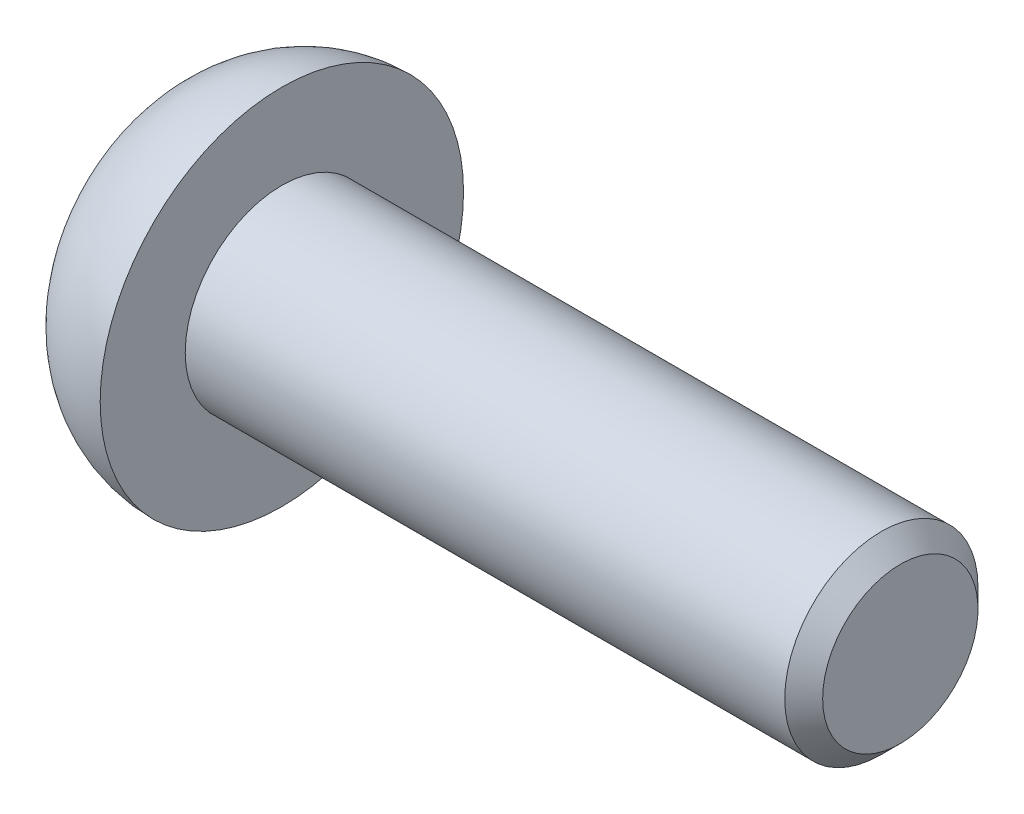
ISO-10303-21;
HEADER;
FILE_DESCRIPTION(('STEP AP214'),'2;1');
FILE_NAME('part.step','',(''),(''),'','','');
FILE_SCHEMA(('AUTOMOTIVE_DESIGN { 1 0 10303 214 1 1 1 1 }'));
ENDSEC;
DATA;
#1=APPLICATION_CONTEXT('core data for automotive mechanical design processes');
#2=APPLICATION_PROTOCOL_DEFINITION('international standard','automotive_design',2000,#1);
#3=PRODUCT_CONTEXT('',#1,'mechanical');
#4=PRODUCT('Part','Part','',(#3));
#5=PRODUCT_RELATED_PRODUCT_CATEGORY('part','',(#4));
#6=PRODUCT_DEFINITION_FORMATION('','',#4);
#7=PRODUCT_DEFINITION_CONTEXT('part definition',#1,'design');
#8=PRODUCT_DEFINITION('design','',#6,#7);
#9=PRODUCT_DEFINITION_SHAPE('','',#8);
#10=(LENGTH_UNIT() NAMED_UNIT(*) SI_UNIT(.MILLI.,.METRE.));
#11=(NAMED_UNIT(*) PLANE_ANGLE_UNIT() SI_UNIT($,.RADIAN.));
#12=(NAMED_UNIT(*) SI_UNIT($,.STERADIAN.) SOLID_ANGLE_UNIT());
#13=UNCERTAINTY_MEASURE_WITH_UNIT(LENGTH_MEASURE(1.E-05),#10,'distance_accuracy_value','');
#14=(GEOMETRIC_REPRESENTATION_CONTEXT(3) GLOBAL_UNCERTAINTY_ASSIGNED_CONTEXT((#13)) GLOBAL_UNIT_ASSIGNED_CONTEXT((#10,
#11,#12)) REPRESENTATION_CONTEXT('',''));
#15=CARTESIAN_POINT('',(0.,0.,0.));
#16=DIRECTION('',(0.,0.,1.));
#17=DIRECTION('',(1.,0.,0.));
#18=AXIS2_PLACEMENT_3D('',#15,#16,#17);
#19=CARTESIAN_POINT('',(-2.7,0.,0.));
#20=DIRECTION('',(1.,0.,0.));
#21=DIRECTION('',(0.,0.,-1.));
#22=AXIS2_PLACEMENT_3D('',#19,#20,#21);
#23=PLANE('',#22);
#24=CARTESIAN_POINT('',(-2.7,0.,0.));
#25=DIRECTION('',(-1.,0.,0.));
#26=DIRECTION('',(0.,0.,1.));
#27=AXIS2_PLACEMENT_3D('',#24,#25,#26);
#28=CIRCLE('',#27,3.3618598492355);
#29=CARTESIAN_POINT('',(-2.7,0.,3.3618598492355));
#30=VERTEX_POINT('',#29);
#31=EDGE_CURVE('E209',#30,#30,#28,.T.);
#32=ORIENTED_EDGE('',*,*,#31,.T.);
#33=EDGE_LOOP('',(#32));
#34=FACE_BOUND('',#33,.T.);
#35=CARTESIAN_POINT('',(-2.7,0.,0.));
#36=DIRECTION('',(1.,0.,0.));
#37=DIRECTION('',(0.,0.,-1.));
#38=AXIS2_PLACEMENT_3D('',#35,#36,#37);
#39=CIRCLE('',#38,2.35);
#40=CARTESIAN_POINT('',(-2.7,0.,-2.35));
#41=VERTEX_POINT('',#40);
#42=EDGE_CURVE('E196',#41,#41,#39,.F.);
#43=ORIENTED_EDGE('',*,*,#42,.F.);
#44=EDGE_LOOP('',(#43));
#45=FACE_BOUND('',#44,.T.);
#46=ADVANCED_FACE('F34',(#34,#45),#23,.F.);
#47=CARTESIAN_POINT('',(0.,0.,0.));
#48=DIRECTION('',(-1.,0.,0.));
#49=DIRECTION('',(0.,0.,1.));
#50=AXIS2_PLACEMENT_3D('',#47,#48,#49);
#51=DEGENERATE_TOROIDAL_SURFACE('',#50,1.30700000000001,3.39299999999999,.T.);
#52=ORIENTED_EDGE('',*,*,#31,.F.);
#53=EDGE_LOOP('',(#52));
#54=FACE_BOUND('',#53,.T.);
#55=CARTESIAN_POINT('',(0.,0.,0.));
#56=DIRECTION('',(-1.,0.,0.));
#57=DIRECTION('',(0.,0.,1.));
#58=AXIS2_PLACEMENT_3D('',#55,#56,#57);
#59=CIRCLE('',#58,4.7);
#60=CARTESIAN_POINT('',(0.,0.,4.7));
#61=VERTEX_POINT('',#60);
#62=EDGE_CURVE('E206',#61,#61,#59,.T.);
#63=ORIENTED_EDGE('',*,*,#62,.T.);
#64=EDGE_LOOP('',(#63));
#65=FACE_BOUND('',#64,.T.);
#66=ADVANCED_FACE('F246',(#54,#65),#51,.T.);
#67=CARTESIAN_POINT('',(0.,4.7,0.));
#68=DIRECTION('',(-1.,0.,0.));
#69=DIRECTION('',(0.,0.,1.));
#70=AXIS2_PLACEMENT_3D('',#67,#68,#69);
#71=PLANE('',#70);
#72=ORIENTED_EDGE('',*,*,#62,.F.);
#73=EDGE_LOOP('',(#72));
#74=FACE_BOUND('',#73,.T.);
#75=CARTESIAN_POINT('',(0.,0.,0.));
#76=DIRECTION('',(-1.,0.,0.));
#77=DIRECTION('',(0.,0.,1.));
#78=AXIS2_PLACEMENT_3D('',#75,#76,#77);
#79=CIRCLE('',#78,2.5);
#80=CARTESIAN_POINT('',(0.,0.,2.5));
#81=VERTEX_POINT('',#80);
#82=EDGE_CURVE('E203',#81,#81,#79,.T.);
#83=ORIENTED_EDGE('',*,*,#82,.T.);
#84=EDGE_LOOP('',(#83));
#85=FACE_BOUND('',#84,.T.);
#86=ADVANCED_FACE('F251',(#74,#85),#71,.F.);
#87=CARTESIAN_POINT('',(16.,0.,0.));
#88=DIRECTION('',(-1.,0.,0.));
#89=DIRECTION('',(0.,0.,1.));
#90=AXIS2_PLACEMENT_3D('',#87,#88,#89);
#91=CYLINDRICAL_SURFACE('',#90,2.5);
#92=ORIENTED_EDGE('',*,*,#82,.F.);
#93=EDGE_LOOP('',(#92));
#94=FACE_BOUND('',#93,.T.);
#95=CARTESIAN_POINT('',(15.5095,0.,0.));
#96=DIRECTION('',(-1.,0.,0.));
#97=DIRECTION('',(0.,0.,1.));
#98=AXIS2_PLACEMENT_3D('',#95,#96,#97);
#99=CIRCLE('',#98,2.5);
#100=CARTESIAN_POINT('',(15.5095,0.,2.5));
#101=VERTEX_POINT('',#100);
#102=EDGE_CURVE('E200',#101,#101,#99,.T.);
#103=ORIENTED_EDGE('',*,*,#102,.T.);
#104=EDGE_LOOP('',(#103));
#105=FACE_BOUND('',#104,.T.);
#106=ADVANCED_FACE('F270',(#94,#105),#91,.T.);
#107=CARTESIAN_POINT('',(16.,0.,0.));
#108=DIRECTION('',(-1.,0.,0.));
#109=DIRECTION('',(0.,0.,1.));
#110=AXIS2_PLACEMENT_3D('',#107,#108,#109);
#111=CONICAL_SURFACE('',#110,2.0095,0.785398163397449);
#112=ORIENTED_EDGE('',*,*,#102,.F.);
#113=EDGE_LOOP('',(#112));
#114=FACE_BOUND('',#113,.T.);
#115=CARTESIAN_POINT('',(16.,0.,0.));
#116=DIRECTION('',(-1.,0.,0.));
#117=DIRECTION('',(0.,0.,1.));
#118=AXIS2_PLACEMENT_3D('',#115,#116,#117);
#119=CIRCLE('',#118,2.0095);
#120=CARTESIAN_POINT('',(16.,0.,2.0095));
#121=VERTEX_POINT('',#120);
#122=EDGE_CURVE('E197',#121,#121,#119,.T.);
#123=ORIENTED_EDGE('',*,*,#122,.T.);
#124=EDGE_LOOP('',(#123));
#125=FACE_BOUND('',#124,.T.);
#126=ADVANCED_FACE('F263',(#114,#125),#111,.T.);
#127=CARTESIAN_POINT('',(16.,2.0095,0.));
#128=DIRECTION('',(-1.,0.,0.));
#129=DIRECTION('',(0.,0.,1.));
#130=AXIS2_PLACEMENT_3D('',#127,#128,#129);
#131=PLANE('',#130);
#132=ORIENTED_EDGE('',*,*,#122,.F.);
#133=EDGE_LOOP('',(#132));
#134=FACE_BOUND('',#133,.T.);
#135=ADVANCED_FACE('F258',(#134),#131,.F.);
#136=CARTESIAN_POINT('',(-2.0253193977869,0.,0.));
#137=DIRECTION('',(-1.,0.,0.));
#138=DIRECTION('',(0.,-1.,0.));
#139=AXIS2_PLACEMENT_3D('',#136,#137,#138);
#140=CYLINDRICAL_SURFACE('',#139,2.35);
#141=CARTESIAN_POINT('',(-2.655,0.,0.));
#142=DIRECTION('',(-1.,0.,0.));
#143=DIRECTION('',(0.,-1.,0.));
#144=AXIS2_PLACEMENT_3D('',#141,#142,#143);
#145=CIRCLE('',#144,2.35);
#146=CARTESIAN_POINT('',(-2.655,-2.35,0.));
#147=VERTEX_POINT('',#146);
#148=EDGE_CURVE('E174',#147,#147,#145,.T.);
#149=ORIENTED_EDGE('',*,*,#148,.F.);
#150=EDGE_LOOP('',(#149));
#151=FACE_BOUND('',#150,.T.);
#152=ORIENTED_EDGE('',*,*,#42,.T.);
#153=EDGE_LOOP('',(#152));
#154=FACE_BOUND('',#153,.T.);
#155=ADVANCED_FACE('F243',(#151,#154),#140,.F.);
#156=CARTESIAN_POINT('',(-2.0253193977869,0.,0.));
#157=DIRECTION('',(-1.,0.,0.));
#158=DIRECTION('',(0.,-1.,0.));
#159=AXIS2_PLACEMENT_3D('',#156,#157,#158);
#160=CONICAL_SURFACE('',#159,0.,1.30899693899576);
#161=CARTESIAN_POINT('',(-2.55114544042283,0.439753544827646,1.9125030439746));
#162=CARTESIAN_POINT('',(-2.54071561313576,0.449737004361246,1.87022562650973));
#163=CARTESIAN_POINT('',(-2.5307382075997,0.463293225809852,1.82865349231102));
#164=CARTESIAN_POINT('',(-2.51220763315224,0.497228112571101,1.74795500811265));
#165=CARTESIAN_POINT('',(-2.50365739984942,0.517620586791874,1.70883380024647));
#166=CARTESIAN_POINT('',(-2.48853284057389,0.564906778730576,1.63418174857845));
#167=CARTESIAN_POINT('',(-2.48196233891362,0.591812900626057,1.59865794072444));
#168=CARTESIAN_POINT('',(-2.47137390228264,0.651414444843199,1.53246945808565));
#169=CARTESIAN_POINT('',(-2.46735280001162,0.684102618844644,1.50179878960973));
#170=CARTESIAN_POINT('',(-2.46236108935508,0.75278870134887,1.44755487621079));
#171=CARTESIAN_POINT('',(-2.46126404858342,0.788577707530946,1.42372873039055));
#172=CARTESIAN_POINT('',(-2.46186376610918,0.863523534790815,1.38219827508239));
#173=CARTESIAN_POINT('',(-2.46356024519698,0.902680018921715,1.36449335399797));
#174=CARTESIAN_POINT('',(-2.46947697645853,0.981800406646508,1.3361750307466));
#175=CARTESIAN_POINT('',(-2.47361092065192,1.02169350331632,1.32534425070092));
#176=CARTESIAN_POINT('',(-2.48399181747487,1.10243546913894,1.31002812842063));
#177=CARTESIAN_POINT('',(-2.49024044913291,1.14328507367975,1.30554784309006));
#178=CARTESIAN_POINT('',(-2.50478059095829,1.22698093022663,1.30286548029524));
#179=CARTESIAN_POINT('',(-2.51316049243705,1.26982205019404,1.30499743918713));
#180=CARTESIAN_POINT('',(-2.53126708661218,1.35428061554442,1.31603359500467));
#181=CARTESIAN_POINT('',(-2.5409921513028,1.39589946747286,1.32492966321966));
#182=CARTESIAN_POINT('',(-2.55114621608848,1.4364025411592,1.33709018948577));
#183=B_SPLINE_CURVE_WITH_KNOTS('',3,(#161,#162,#163,#164,#165,#166,#167,#168,#169,#170,#171,
#172,#173,#174,#175,#176,#177,#178,#179,#180,#181,#182),.UNSPECIFIED.,.F.,.F.,(4,2,2,2,2,2,2,2,
2,2,4),(0.,0.133919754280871,0.268111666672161,0.402561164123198,0.536843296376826,
0.665217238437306,0.793578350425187,0.917646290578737,1.04181297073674,1.17235260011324,
1.30273560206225),.UNSPECIFIED.);
#184=CARTESIAN_POINT('',(-2.55109606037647,0.43980094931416,1.9123030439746));
#185=VERTEX_POINT('',#184);
#186=CARTESIAN_POINT('',(-2.55109606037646,1.4362025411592,1.3370303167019));
#187=VERTEX_POINT('',#186);
#188=EDGE_CURVE('E11',#185,#187,#183,.T.);
#189=ORIENTED_EDGE('',*,*,#188,.F.);
#190=CARTESIAN_POINT('',(-2.5510466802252,-0.439848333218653,1.91210304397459));
#191=CARTESIAN_POINT('',(-2.55717942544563,-0.433993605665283,1.93693413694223));
#192=CARTESIAN_POINT('',(-2.56309008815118,-0.425982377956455,1.96131383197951));
#193=CARTESIAN_POINT('',(-2.57435861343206,-0.405906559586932,2.00848949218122));
#194=CARTESIAN_POINT('',(-2.57971629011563,-0.393840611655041,2.03128492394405));
#195=CARTESIAN_POINT('',(-2.58977141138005,-0.365904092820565,2.0746170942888));
#196=CARTESIAN_POINT('',(-2.59446813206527,-0.350029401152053,2.09515135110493));
#197=CARTESIAN_POINT('',(-2.60309788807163,-0.314913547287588,2.13327568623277));
#198=CARTESIAN_POINT('',(-2.607031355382,-0.295674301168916,2.15086742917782));
#199=CARTESIAN_POINT('',(-2.61399024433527,-0.254755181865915,2.18224039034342));
#200=CARTESIAN_POINT('',(-2.61703154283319,-0.233128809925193,2.19608784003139));
#201=CARTESIAN_POINT('',(-2.6222449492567,-0.187756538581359,2.21995686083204));
#202=CARTESIAN_POINT('',(-2.62441696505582,-0.164010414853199,2.22997802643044));
#203=CARTESIAN_POINT('',(-2.62780973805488,-0.115636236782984,2.24568124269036));
#204=CARTESIAN_POINT('',(-2.62905021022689,-0.0910387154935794,2.25145316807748));
#205=CARTESIAN_POINT('',(-2.63063260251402,-0.0412008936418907,2.25882234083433));
#206=CARTESIAN_POINT('',(-2.63097468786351,-0.0159607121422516,2.26042035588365));
#207=CARTESIAN_POINT('',(-2.63075535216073,0.0341234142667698,2.25939721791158));
#208=CARTESIAN_POINT('',(-2.63020479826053,0.0589684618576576,2.25682681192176));
#209=CARTESIAN_POINT('',(-2.62823116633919,0.107865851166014,2.24764508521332));
#210=CARTESIAN_POINT('',(-2.62680802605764,0.131918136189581,2.24103347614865));
#211=CARTESIAN_POINT('',(-2.62311568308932,0.178560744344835,2.22397704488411));
#212=CARTESIAN_POINT('',(-2.62084621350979,0.201150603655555,2.21353101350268));
#213=CARTESIAN_POINT('',(-2.61550455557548,0.244239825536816,2.18913496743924));
#214=CARTESIAN_POINT('',(-2.61243249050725,0.264739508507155,2.17518549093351));
#215=CARTESIAN_POINT('',(-2.60550026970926,0.303348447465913,2.14401587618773));
#216=CARTESIAN_POINT('',(-2.60163097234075,0.321425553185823,2.12675797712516));
#217=CARTESIAN_POINT('',(-2.59319880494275,0.354438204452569,2.08959540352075));
#218=CARTESIAN_POINT('',(-2.58863559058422,0.369372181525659,2.06968941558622));
#219=CARTESIAN_POINT('',(-2.57886409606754,0.39582442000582,2.02765264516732));
#220=CARTESIAN_POINT('',(-2.57365119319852,0.407315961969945,2.00550615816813));
#221=CARTESIAN_POINT('',(-2.56271023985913,0.426493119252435,1.95974792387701));
#222=CARTESIAN_POINT('',(-2.55698232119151,0.434179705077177,1.93613655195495));
#223=CARTESIAN_POINT('',(-2.5510466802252,0.439848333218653,1.91210304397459));
#224=B_SPLINE_CURVE_WITH_KNOTS('',3,(#190,#191,#192,#193,#194,#195,#196,#197,#198,#199,#200,
#201,#202,#203,#204,#205,#206,#207,#208,#209,#210,#211,#212,#213,#214,#215,#216,#217,#218,#219,
#220,#221,#222,#223),.UNSPECIFIED.,.F.,.F.,(4,2,2,2,2,2,2,2,2,2,2,2,2,2,2,2,4),(0.,
0.0786310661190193,0.157288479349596,0.236031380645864,0.314729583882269,0.391927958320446,
0.469134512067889,0.544657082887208,0.62016576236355,0.694762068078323,0.769363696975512,
0.843988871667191,0.918602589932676,0.99412494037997,1.06968488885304,1.14581696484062,
1.22192961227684),.UNSPECIFIED.);
#225=CARTESIAN_POINT('',(-2.55109606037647,-0.43980094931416,1.9123030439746));
#226=VERTEX_POINT('',#225);
#227=EDGE_CURVE('E128',#226,#185,#224,.T.);
#228=ORIENTED_EDGE('',*,*,#227,.F.);
#229=CARTESIAN_POINT('',(-2.55114621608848,-1.4364025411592,1.33709018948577));
#230=CARTESIAN_POINT('',(-2.5407163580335,-1.3947975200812,1.3245972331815));
#231=CARTESIAN_POINT('',(-2.53073891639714,-1.35201689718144,1.3155510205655));
#232=CARTESIAN_POINT('',(-2.51220825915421,-1.26516251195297,1.30458990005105));
#233=CARTESIAN_POINT('',(-2.50365797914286,-1.2210862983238,1.3026895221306));
#234=CARTESIAN_POINT('',(-2.48853331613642,-1.13279256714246,1.30631419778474));
#235=CARTESIAN_POINT('',(-2.48196275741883,-1.08857494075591,1.31185351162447));
#236=CARTESIAN_POINT('',(-2.47137419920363,-1.00145314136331,1.33037540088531));
#237=CARTESIAN_POINT('',(-2.46735303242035,-0.958547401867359,1.34334870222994));
#238=CARTESIAN_POINT('',(-2.46236119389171,-0.877227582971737,1.37571035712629));
#239=CARTESIAN_POINT('',(-2.46126408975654,-0.838698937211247,1.39479134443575));
#240=CARTESIAN_POINT('',(-2.46186368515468,-0.765259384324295,1.43893087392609));
#241=CARTESIAN_POINT('',(-2.46356010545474,-0.730348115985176,1.46398881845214));
#242=CARTESIAN_POINT('',(-2.46947672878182,-0.666263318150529,1.51834972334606));
#243=CARTESIAN_POINT('',(-2.47361062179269,-0.63693693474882,1.54748266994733));
#244=CARTESIAN_POINT('',(-2.48399142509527,-0.583301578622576,1.609749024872));
#245=CARTESIAN_POINT('',(-2.49024001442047,-0.558996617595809,1.64288559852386));
#246=CARTESIAN_POINT('',(-2.50478006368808,-0.514825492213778,1.71402693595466));
#247=CARTESIAN_POINT('',(-2.51315991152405,-0.495251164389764,1.75219426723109));
#248=CARTESIAN_POINT('',(-2.53126640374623,-0.462579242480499,1.83085532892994));
#249=CARTESIAN_POINT('',(-2.54099142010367,-0.449473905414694,1.87134621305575));
#250=CARTESIAN_POINT('',(-2.55114544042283,-0.439753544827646,1.9125030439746));
#251=B_SPLINE_CURVE_WITH_KNOTS('',3,(#229,#230,#231,#232,#233,#234,#235,#236,#237,#238,#239,
#240,#241,#242,#243,#244,#245,#246,#247,#248,#249,#250),.UNSPECIFIED.,.F.,.F.,(4,2,2,2,2,2,2,2,
2,2,4),(0.,0.133919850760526,0.268111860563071,0.402561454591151,0.536843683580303,
0.665217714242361,0.793578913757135,0.917646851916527,1.04181352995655,1.17235288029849,
1.30273560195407),.UNSPECIFIED.);
#252=CARTESIAN_POINT('',(-2.55109606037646,-1.4362025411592,1.3370303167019));
#253=VERTEX_POINT('',#252);
#254=EDGE_CURVE('E219',#253,#226,#251,.T.);
#255=ORIENTED_EDGE('',*,*,#254,.F.);
#256=CARTESIAN_POINT('',(-2.55102602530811,-1.87579142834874,0.57507272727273));
#257=CARTESIAN_POINT('',(-2.55715934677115,-1.89437192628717,0.592555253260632));
#258=CARTESIAN_POINT('',(-2.56307065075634,-1.9114835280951,0.611679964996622));
#259=CARTESIAN_POINT('',(-2.57434057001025,-1.94230894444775,0.652648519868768));
#260=CARTESIAN_POINT('',(-2.57969899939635,-1.95602161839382,0.674493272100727));
#261=CARTESIAN_POINT('',(-2.58975571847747,-1.97958890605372,0.720349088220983));
#262=CARTESIAN_POINT('',(-2.59445328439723,-1.98943931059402,0.744362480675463));
#263=CARTESIAN_POINT('',(-2.60308480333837,-2.0049073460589,0.793833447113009));
#264=CARTESIAN_POINT('',(-2.60701918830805,-2.0105273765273,0.819290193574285));
#265=CARTESIAN_POINT('',(-2.61397994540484,-2.0172470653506,0.870412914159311));
#266=CARTESIAN_POINT('',(-2.61702219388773,-2.01843083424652,0.89606565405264));
#267=CARTESIAN_POINT('',(-2.62223753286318,-2.0164251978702,0.947294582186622));
#268=CARTESIAN_POINT('',(-2.62441053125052,-2.01323532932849,0.972870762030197));
#269=CARTESIAN_POINT('',(-2.62780525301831,-2.0026565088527,1.02261800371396));
#270=CARTESIAN_POINT('',(-2.62904669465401,-1.99536067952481,1.04680754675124));
#271=CARTESIAN_POINT('',(-2.63063102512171,-1.97683190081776,1.09365666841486));
#272=CARTESIAN_POINT('',(-2.63097407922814,-1.96559967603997,1.11631652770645));
#273=CARTESIAN_POINT('',(-2.6307566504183,-1.93967899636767,1.15918397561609));
#274=CARTESIAN_POINT('',(-2.63020704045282,-1.92503396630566,1.17941789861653));
#275=CARTESIAN_POINT('',(-2.62823527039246,-1.89264019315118,1.21717933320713));
#276=CARTESIAN_POINT('',(-2.62681304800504,-1.87489122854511,1.23470665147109));
#277=CARTESIAN_POINT('',(-2.62312251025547,-1.83680413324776,1.26657891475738));
#278=CARTESIAN_POINT('',(-2.6208539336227,-1.8164652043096,1.28092287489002));
#279=CARTESIAN_POINT('',(-2.61551401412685,-1.77379741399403,1.30604873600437));
#280=CARTESIAN_POINT('',(-2.61244279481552,-1.75146885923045,1.31683118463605));
#281=CARTESIAN_POINT('',(-2.60551223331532,-1.70517395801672,1.33469081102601));
#282=CARTESIAN_POINT('',(-2.60164375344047,-1.68119098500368,1.34172129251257));
#283=CARTESIAN_POINT('',(-2.59321314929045,-1.63250291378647,1.35173837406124));
#284=CARTESIAN_POINT('',(-2.58865067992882,-1.60779746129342,1.35472295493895));
#285=CARTESIAN_POINT('',(-2.57887781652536,-1.55815287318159,1.35662221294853));
#286=CARTESIAN_POINT('',(-2.57366245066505,-1.53321347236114,1.3555035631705));
#287=CARTESIAN_POINT('',(-2.56271592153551,-1.48396894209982,1.34923304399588));
#288=CARTESIAN_POINT('',(-2.55698488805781,-1.45966365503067,1.34408218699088));
#289=CARTESIAN_POINT('',(-2.55104590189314,-1.4360025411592,1.33697042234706));
#290=B_SPLINE_CURVE_WITH_KNOTS('',3,(#256,#257,#258,#259,#260,#261,#262,#263,#264,#265,#266,
#267,#268,#269,#270,#271,#272,#273,#274,#275,#276,#277,#278,#279,#280,#281,#282,#283,#284,#285,
#286,#287,#288,#289),.UNSPECIFIED.,.F.,.F.,(4,2,2,2,2,2,2,2,2,2,2,2,2,2,2,2,4),(0.,
0.0786321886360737,0.157290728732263,0.236034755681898,0.314734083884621,0.391933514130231,
0.469141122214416,0.544664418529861,0.620173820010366,0.694770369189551,0.769372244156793,
0.843997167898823,0.918610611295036,0.994132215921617,1.06969149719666,1.14586583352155,
1.22202105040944),.UNSPECIFIED.);
#291=CARTESIAN_POINT('',(-2.55109606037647,-1.8760034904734,0.57527272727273));
#292=VERTEX_POINT('',#291);
#293=EDGE_CURVE('E476',#292,#253,#290,.T.);
#294=ORIENTED_EDGE('',*,*,#293,.F.);
#295=CARTESIAN_POINT('',(-2.55116211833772,-1.87620349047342,-0.575461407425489));
#296=CARTESIAN_POINT('',(-2.54073162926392,-1.84457888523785,-0.54567916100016));
#297=CARTESIAN_POINT('',(-2.53075344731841,-1.81535129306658,-0.513155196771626));
#298=CARTESIAN_POINT('',(-2.51222109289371,-1.76242518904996,-0.44342118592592));
#299=CARTESIAN_POINT('',(-2.5036698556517,-1.73873803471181,-0.406201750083));
#300=CARTESIAN_POINT('',(-2.48854306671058,-1.6977235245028,-0.32792720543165));
#301=CARTESIAN_POINT('',(-2.48197133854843,-1.6804084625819,-0.286864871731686));
#302=CARTESIAN_POINT('',(-2.47138028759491,-1.65288106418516,-0.202155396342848));
#303=CARTESIAN_POINT('',(-2.46735779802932,-1.64265991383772,-0.158511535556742));
#304=CARTESIAN_POINT('',(-2.46236333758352,-1.6300192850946,-0.071905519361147));
#305=CARTESIAN_POINT('',(-2.4612649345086,-1.62727632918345,-0.0289978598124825));
#306=CARTESIAN_POINT('',(-2.46186202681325,-1.62877621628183,0.0566737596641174));
#307=CARTESIAN_POINT('',(-2.46355724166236,-1.63301835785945,0.0994377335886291));
#308=CARTESIAN_POINT('',(-2.46947165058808,-1.64804812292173,0.182119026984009));
#309=CARTESIAN_POINT('',(-2.47360449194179,-1.65861197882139,0.222083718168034));
#310=CARTESIAN_POINT('',(-2.48398337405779,-1.68571310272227,0.299668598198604));
#311=CARTESIAN_POINT('',(-2.49023109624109,-1.70225512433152,0.337286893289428));
#312=CARTESIAN_POINT('',(-2.50477321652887,-1.74178459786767,0.411132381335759));
#313=CARTESIAN_POINT('',(-2.51315691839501,-1.76506170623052,0.447186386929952));
#314=CARTESIAN_POINT('',(-2.53127244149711,-1.81687418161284,0.514844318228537));
#315=CARTESIAN_POINT('',(-2.54100263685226,-1.84540322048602,0.546453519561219));
#316=CARTESIAN_POINT('',(-2.55116211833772,-1.87620349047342,0.575461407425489));
#317=B_SPLINE_CURVE_WITH_KNOTS('',3,(#295,#296,#297,#298,#299,#300,#301,#302,#303,#304,#305,
#306,#307,#308,#309,#310,#311,#312,#313,#314,#315,#316),.UNSPECIFIED.,.F.,.F.,(4,2,2,2,2,2,2,2,
2,2,4),(0.,0.133921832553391,0.268115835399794,0.402567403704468,0.536851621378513,
0.665227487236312,0.793590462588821,0.917658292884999,1.04182499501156,1.17242797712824,
1.30287461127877),.UNSPECIFIED.);
#318=CARTESIAN_POINT('',(-2.55109606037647,-1.8760034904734,-0.57527272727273));
#319=VERTEX_POINT('',#318);
#320=EDGE_CURVE('E469',#319,#292,#317,.T.);
#321=ORIENTED_EDGE('',*,*,#320,.F.);
#322=CARTESIAN_POINT('',(-2.55104590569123,-1.436002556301,-1.33697042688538));
#323=CARTESIAN_POINT('',(-2.55717867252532,-1.46043423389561,-1.34431580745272));
#324=CARTESIAN_POINT('',(-2.56308935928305,-1.48555325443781,-1.34956790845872));
#325=CARTESIAN_POINT('',(-2.57435793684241,-1.53644645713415,-1.35576993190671));
#326=CARTESIAN_POINT('',(-2.57971564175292,-1.5622208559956,-1.35671841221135));
#327=CARTESIAN_POINT('',(-2.5897708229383,-1.61371591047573,-1.35419112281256));
#328=CARTESIAN_POINT('',(-2.59446757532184,-1.63943647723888,-1.35071054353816));
#329=CARTESIAN_POINT('',(-2.60309739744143,-1.69001114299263,-1.33936183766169));
#330=CARTESIAN_POINT('',(-2.60703089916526,-1.71486572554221,-1.33149620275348));
#331=CARTESIAN_POINT('',(-2.61398985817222,-1.76249521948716,-1.31174600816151));
#332=CARTESIAN_POINT('',(-2.61703119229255,-1.78530073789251,-1.29994089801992));
#333=CARTESIAN_POINT('',(-2.62224467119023,-1.82865825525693,-1.27258215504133));
#334=CARTESIAN_POINT('',(-2.62441672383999,-1.84921001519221,-1.25702812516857));
#335=CARTESIAN_POINT('',(-2.62780956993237,-1.88699673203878,-1.22298671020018));
#336=CARTESIAN_POINT('',(-2.62905007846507,-1.90429425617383,-1.20457070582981));
#337=CARTESIAN_POINT('',(-2.63063254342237,-1.93559533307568,-1.16509467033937));
#338=CARTESIAN_POINT('',(-2.63097466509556,-1.94959949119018,-1.1440351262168));
#339=CARTESIAN_POINT('',(-2.63075540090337,-1.97375578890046,-1.10014958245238));
#340=CARTESIAN_POINT('',(-2.6302048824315,-1.98395242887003,-1.07734800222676));
#341=CARTESIAN_POINT('',(-2.62823132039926,-2.00044982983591,-1.03041085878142));
#342=CARTESIAN_POINT('',(-2.6268082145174,-2.00675031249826,-1.00627520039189));
#343=CARTESIAN_POINT('',(-2.62311593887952,-2.0153006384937,-0.957353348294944));
#344=CARTESIAN_POINT('',(-2.62084650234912,-2.01754920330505,-0.932566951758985));
#345=CARTESIAN_POINT('',(-2.61550490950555,-2.01796654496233,-0.883052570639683));
#346=CARTESIAN_POINT('',(-2.61243287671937,-2.01613594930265,-0.858324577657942));
#347=CARTESIAN_POINT('',(-2.60550072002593,-2.00844706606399,-0.809303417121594));
#348=CARTESIAN_POINT('',(-2.60163145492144,-2.00254000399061,-0.785019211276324));
#349=CARTESIAN_POINT('',(-2.59319934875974,-1.98686292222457,-0.737848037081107));
#350=CARTESIAN_POINT('',(-2.58863616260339,-1.97709097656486,-0.714961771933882));
#351=CARTESIAN_POINT('',(-2.57886178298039,-1.95390550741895,-0.671021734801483));
#352=CARTESIAN_POINT('',(-2.57364559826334,-1.94046287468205,-0.649984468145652));
#353=CARTESIAN_POINT('',(-2.56269749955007,-1.91040208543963,-0.610476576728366));
#354=CARTESIAN_POINT('',(-2.55696571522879,-1.89378472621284,-0.592005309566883));
#355=CARTESIAN_POINT('',(-2.55102602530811,-1.87579142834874,-0.57507272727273));
#356=B_SPLINE_CURVE_WITH_KNOTS('',3,(#322,#323,#324,#325,#326,#327,#328,#329,#330,#331,#332,
#333,#334,#335,#336,#337,#338,#339,#340,#341,#342,#343,#344,#345,#346,#347,#348,#349,#350,#351,
#352,#353,#354,#355),.UNSPECIFIED.,.F.,.F.,(4,2,2,2,2,2,2,2,2,2,2,2,2,2,2,2,4),(0.,
0.0786311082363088,0.157288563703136,0.236031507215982,0.314729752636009,0.391928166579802,
0.469134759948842,0.544657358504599,0.620166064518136,0.694762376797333,0.76936401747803,
0.843989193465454,0.918602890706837,0.994125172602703,1.06968513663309,1.14586263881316,
1.22202103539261),.UNSPECIFIED.);
#357=CARTESIAN_POINT('',(-2.55109606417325,-1.436202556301,-1.3370303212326));
#358=VERTEX_POINT('',#357);
#359=EDGE_CURVE('E464',#358,#319,#356,.T.);
#360=ORIENTED_EDGE('',*,*,#359,.F.);
#361=CARTESIAN_POINT('',(-2.5511454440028,-0.439753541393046,-1.9125030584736));
#362=CARTESIAN_POINT('',(-2.54071561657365,-0.449737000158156,-1.87022564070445));
#363=CARTESIAN_POINT('',(-2.53073821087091,-0.463293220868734,-1.82865350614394));
#364=CARTESIAN_POINT('',(-2.51220763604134,-0.497228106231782,-1.7479550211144));
#365=CARTESIAN_POINT('',(-2.503657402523,-0.517620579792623,-1.70883381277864));
#366=CARTESIAN_POINT('',(-2.48853284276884,-0.564906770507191,-1.63418176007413));
#367=CARTESIAN_POINT('',(-2.48196234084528,-0.591812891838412,-1.59865795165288));
#368=CARTESIAN_POINT('',(-2.4713739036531,-0.651414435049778,-1.53246946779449));
#369=CARTESIAN_POINT('',(-2.46735280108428,-0.684102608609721,-1.50179879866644));
#370=CARTESIAN_POINT('',(-2.46236108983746,-0.752788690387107,-1.44755488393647));
#371=CARTESIAN_POINT('',(-2.46126404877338,-0.788577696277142,-1.42372873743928));
#372=CARTESIAN_POINT('',(-2.46186376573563,-0.863523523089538,-1.3821982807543));
#373=CARTESIAN_POINT('',(-2.46356024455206,-0.902680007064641,-1.36449335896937));
#374=CARTESIAN_POINT('',(-2.4694769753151,-0.981800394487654,-1.33617503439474));
#375=CARTESIAN_POINT('',(-2.47361091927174,-1.02169349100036,-1.32534425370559));
#376=CARTESIAN_POINT('',(-2.48399181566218,-1.10243545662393,-1.31002813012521));
#377=CARTESIAN_POINT('',(-2.49024044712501,-1.14328506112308,-1.30554784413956));
#378=CARTESIAN_POINT('',(-2.504780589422,-1.22698092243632,-1.30286547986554));
#379=CARTESIAN_POINT('',(-2.513160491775,-1.26982204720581,-1.30499743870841));
#380=CARTESIAN_POINT('',(-2.53126708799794,-1.35428062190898,-1.31603359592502));
#381=CARTESIAN_POINT('',(-2.54099215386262,-1.39589947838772,-1.32492966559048));
#382=CARTESIAN_POINT('',(-2.55114621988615,-1.436402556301,-1.33709019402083));
#383=B_SPLINE_CURVE_WITH_KNOTS('',3,(#361,#362,#363,#364,#365,#366,#367,#368,#369,#370,#371,
#372,#373,#374,#375,#376,#377,#378,#379,#380,#381,#382),.UNSPECIFIED.,.F.,.F.,(4,2,2,2,2,2,2,2,
2,2,4),(0.,0.133919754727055,0.268111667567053,0.402561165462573,0.536843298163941,
0.665217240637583,0.793578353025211,0.917646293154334,1.0418129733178,1.17235261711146,
1.30273563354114),.UNSPECIFIED.);
#384=CARTESIAN_POINT('',(-2.55109606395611,-0.43980094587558,-1.9123030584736));
#385=VERTEX_POINT('',#384);
#386=EDGE_CURVE('E459',#385,#358,#383,.T.);
#387=ORIENTED_EDGE('',*,*,#386,.F.);
#388=CARTESIAN_POINT('',(-2.5510466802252,0.439848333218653,-1.91210304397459));
#389=CARTESIAN_POINT('',(-2.55717942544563,0.433993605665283,-1.93693413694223));
#390=CARTESIAN_POINT('',(-2.56309008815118,0.425982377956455,-1.96131383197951));
#391=CARTESIAN_POINT('',(-2.57435861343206,0.405906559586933,-2.00848949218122));
#392=CARTESIAN_POINT('',(-2.57971629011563,0.393840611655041,-2.03128492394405));
#393=CARTESIAN_POINT('',(-2.58977141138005,0.365904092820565,-2.0746170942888));
#394=CARTESIAN_POINT('',(-2.59446813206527,0.350029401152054,-2.09515135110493));
#395=CARTESIAN_POINT('',(-2.60309788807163,0.314913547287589,-2.13327568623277));
#396=CARTESIAN_POINT('',(-2.607031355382,0.295674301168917,-2.15086742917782));
#397=CARTESIAN_POINT('',(-2.61399024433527,0.254755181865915,-2.18224039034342));
#398=CARTESIAN_POINT('',(-2.61703154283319,0.233128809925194,-2.19608784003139));
#399=CARTESIAN_POINT('',(-2.6222449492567,0.18775653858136,-2.21995686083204));
#400=CARTESIAN_POINT('',(-2.62441696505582,0.1640104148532,-2.22997802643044));
#401=CARTESIAN_POINT('',(-2.62780973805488,0.115636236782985,-2.24568124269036));
#402=CARTESIAN_POINT('',(-2.62905021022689,0.0910387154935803,-2.25145316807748));
#403=CARTESIAN_POINT('',(-2.63063260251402,0.0412008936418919,-2.25882234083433));
#404=CARTESIAN_POINT('',(-2.63097468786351,0.0159607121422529,-2.26042035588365));
#405=CARTESIAN_POINT('',(-2.63075535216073,-0.0341234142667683,-2.25939721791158));
#406=CARTESIAN_POINT('',(-2.63020479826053,-0.0589684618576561,-2.25682681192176));
#407=CARTESIAN_POINT('',(-2.62823116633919,-0.107865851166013,-2.24764508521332));
#408=CARTESIAN_POINT('',(-2.62680802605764,-0.131918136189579,-2.24103347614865));
#409=CARTESIAN_POINT('',(-2.62311568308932,-0.178560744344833,-2.22397704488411));
#410=CARTESIAN_POINT('',(-2.62084621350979,-0.201150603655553,-2.21353101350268));
#411=CARTESIAN_POINT('',(-2.61550455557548,-0.244239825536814,-2.18913496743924));
#412=CARTESIAN_POINT('',(-2.61243249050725,-0.264739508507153,-2.17518549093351));
#413=CARTESIAN_POINT('',(-2.60550026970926,-0.303348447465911,-2.14401587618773));
#414=CARTESIAN_POINT('',(-2.60163097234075,-0.321425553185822,-2.12675797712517));
#415=CARTESIAN_POINT('',(-2.59319880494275,-0.354438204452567,-2.08959540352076));
#416=CARTESIAN_POINT('',(-2.58863559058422,-0.369372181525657,-2.06968941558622));
#417=CARTESIAN_POINT('',(-2.57886409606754,-0.395824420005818,-2.02765264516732));
#418=CARTESIAN_POINT('',(-2.57365119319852,-0.407315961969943,-2.00550615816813));
#419=CARTESIAN_POINT('',(-2.56271023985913,-0.426493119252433,-1.95974792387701));
#420=CARTESIAN_POINT('',(-2.55698232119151,-0.434179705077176,-1.93613655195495));
#421=CARTESIAN_POINT('',(-2.5510466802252,-0.439848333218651,-1.91210304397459));
#422=B_SPLINE_CURVE_WITH_KNOTS('',3,(#388,#389,#390,#391,#392,#393,#394,#395,#396,#397,#398,
#399,#400,#401,#402,#403,#404,#405,#406,#407,#408,#409,#410,#411,#412,#413,#414,#415,#416,#417,
#418,#419,#420,#421),.UNSPECIFIED.,.F.,.F.,(4,2,2,2,2,2,2,2,2,2,2,2,2,2,2,2,4),(0.,
0.0786310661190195,0.157288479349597,0.236031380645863,0.314729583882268,0.391927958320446,
0.469134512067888,0.544657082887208,0.620165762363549,0.694762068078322,0.76936369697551,
0.843988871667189,0.918602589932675,0.994124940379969,1.06968488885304,1.14581696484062,
1.22192961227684),.UNSPECIFIED.);
#423=CARTESIAN_POINT('',(-2.55109606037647,0.43980094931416,-1.9123030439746));
#424=VERTEX_POINT('',#423);
#425=EDGE_CURVE('E454',#424,#385,#422,.T.);
#426=ORIENTED_EDGE('',*,*,#425,.F.);
#427=CARTESIAN_POINT('',(-2.55114621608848,1.4364025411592,-1.33709018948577));
#428=CARTESIAN_POINT('',(-2.5407163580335,1.3947975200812,-1.3245972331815));
#429=CARTESIAN_POINT('',(-2.53073891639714,1.35201689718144,-1.3155510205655));
#430=CARTESIAN_POINT('',(-2.51220825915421,1.26516251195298,-1.30458990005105));
#431=CARTESIAN_POINT('',(-2.50365797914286,1.2210862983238,-1.3026895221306));
#432=CARTESIAN_POINT('',(-2.48853331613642,1.13279256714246,-1.30631419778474));
#433=CARTESIAN_POINT('',(-2.48196275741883,1.08857494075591,-1.31185351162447));
#434=CARTESIAN_POINT('',(-2.47137419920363,1.00145314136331,-1.33037540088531));
#435=CARTESIAN_POINT('',(-2.46735303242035,0.95854740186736,-1.34334870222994));
#436=CARTESIAN_POINT('',(-2.46236119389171,0.877227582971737,-1.37571035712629));
#437=CARTESIAN_POINT('',(-2.46126408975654,0.838698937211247,-1.39479134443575));
#438=CARTESIAN_POINT('',(-2.46186368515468,0.765259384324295,-1.43893087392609));
#439=CARTESIAN_POINT('',(-2.46356010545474,0.730348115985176,-1.46398881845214));
#440=CARTESIAN_POINT('',(-2.46947672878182,0.666263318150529,-1.51834972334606));
#441=CARTESIAN_POINT('',(-2.47361062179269,0.63693693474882,-1.54748266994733));
#442=CARTESIAN_POINT('',(-2.48399142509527,0.583301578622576,-1.609749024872));
#443=CARTESIAN_POINT('',(-2.49024001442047,0.55899661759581,-1.64288559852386));
#444=CARTESIAN_POINT('',(-2.50478006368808,0.514825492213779,-1.71402693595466));
#445=CARTESIAN_POINT('',(-2.51315991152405,0.495251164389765,-1.75219426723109));
#446=CARTESIAN_POINT('',(-2.53126640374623,0.462579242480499,-1.83085532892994));
#447=CARTESIAN_POINT('',(-2.54099142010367,0.449473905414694,-1.87134621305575));
#448=CARTESIAN_POINT('',(-2.55114544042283,0.439753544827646,-1.9125030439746));
#449=B_SPLINE_CURVE_WITH_KNOTS('',3,(#427,#428,#429,#430,#431,#432,#433,#434,#435,#436,#437,
#438,#439,#440,#441,#442,#443,#444,#445,#446,#447,#448),.UNSPECIFIED.,.F.,.F.,(4,2,2,2,2,2,2,2,
2,2,4),(0.,0.133919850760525,0.268111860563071,0.402561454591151,0.536843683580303,
0.665217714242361,0.793578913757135,0.917646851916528,1.04181352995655,1.17235288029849,
1.30273560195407),.UNSPECIFIED.);
#450=CARTESIAN_POINT('',(-2.55109606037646,1.4362025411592,-1.3370303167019));
#451=VERTEX_POINT('',#450);
#452=EDGE_CURVE('E445',#451,#424,#449,.T.);
#453=ORIENTED_EDGE('',*,*,#452,.F.);
#454=CARTESIAN_POINT('',(-2.55102602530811,1.87579142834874,-0.57507272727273));
#455=CARTESIAN_POINT('',(-2.55715934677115,1.89437192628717,-0.592555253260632));
#456=CARTESIAN_POINT('',(-2.56307065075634,1.9114835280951,-0.611679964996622));
#457=CARTESIAN_POINT('',(-2.57434057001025,1.94230894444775,-0.652648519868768));
#458=CARTESIAN_POINT('',(-2.57969899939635,1.95602161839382,-0.674493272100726));
#459=CARTESIAN_POINT('',(-2.58975571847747,1.97958890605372,-0.720349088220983));
#460=CARTESIAN_POINT('',(-2.59445328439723,1.98943931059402,-0.744362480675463));
#461=CARTESIAN_POINT('',(-2.60308480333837,2.0049073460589,-0.793833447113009));
#462=CARTESIAN_POINT('',(-2.60701918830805,2.0105273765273,-0.819290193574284));
#463=CARTESIAN_POINT('',(-2.61397994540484,2.0172470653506,-0.870412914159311));
#464=CARTESIAN_POINT('',(-2.61702219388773,2.01843083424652,-0.89606565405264));
#465=CARTESIAN_POINT('',(-2.62223753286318,2.0164251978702,-0.947294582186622));
#466=CARTESIAN_POINT('',(-2.62441053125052,2.01323532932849,-0.972870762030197));
#467=CARTESIAN_POINT('',(-2.62780525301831,2.0026565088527,-1.02261800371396));
#468=CARTESIAN_POINT('',(-2.62904669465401,1.99536067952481,-1.04680754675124));
#469=CARTESIAN_POINT('',(-2.63063102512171,1.97683190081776,-1.09365666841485));
#470=CARTESIAN_POINT('',(-2.63097407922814,1.96559967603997,-1.11631652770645));
#471=CARTESIAN_POINT('',(-2.6307566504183,1.93967899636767,-1.15918397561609));
#472=CARTESIAN_POINT('',(-2.63020704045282,1.92503396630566,-1.17941789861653));
#473=CARTESIAN_POINT('',(-2.62823527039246,1.89264019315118,-1.21717933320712));
#474=CARTESIAN_POINT('',(-2.62681304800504,1.87489122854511,-1.23470665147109));
#475=CARTESIAN_POINT('',(-2.62312251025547,1.83680413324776,-1.26657891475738));
#476=CARTESIAN_POINT('',(-2.6208539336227,1.8164652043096,-1.28092287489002));
#477=CARTESIAN_POINT('',(-2.61551401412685,1.77379741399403,-1.30604873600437));
#478=CARTESIAN_POINT('',(-2.61244279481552,1.75146885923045,-1.31683118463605));
#479=CARTESIAN_POINT('',(-2.60551223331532,1.70517395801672,-1.33469081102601));
#480=CARTESIAN_POINT('',(-2.60164375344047,1.68119098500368,-1.34172129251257));
#481=CARTESIAN_POINT('',(-2.59321314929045,1.63250291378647,-1.35173837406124));
#482=CARTESIAN_POINT('',(-2.58865067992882,1.60779746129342,-1.35472295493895));
#483=CARTESIAN_POINT('',(-2.57887781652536,1.55815287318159,-1.35662221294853));
#484=CARTESIAN_POINT('',(-2.57366245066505,1.53321347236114,-1.3555035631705));
#485=CARTESIAN_POINT('',(-2.56271592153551,1.48396894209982,-1.34923304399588));
#486=CARTESIAN_POINT('',(-2.55698488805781,1.45966365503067,-1.34408218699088));
#487=CARTESIAN_POINT('',(-2.55104590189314,1.4360025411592,-1.33697042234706));
#488=B_SPLINE_CURVE_WITH_KNOTS('',3,(#454,#455,#456,#457,#458,#459,#460,#461,#462,#463,#464,
#465,#466,#467,#468,#469,#470,#471,#472,#473,#474,#475,#476,#477,#478,#479,#480,#481,#482,#483,
#484,#485,#486,#487),.UNSPECIFIED.,.F.,.F.,(4,2,2,2,2,2,2,2,2,2,2,2,2,2,2,2,4),(0.,
0.0786321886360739,0.157290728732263,0.236034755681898,0.314734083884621,0.391933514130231,
0.469141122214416,0.544664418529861,0.620173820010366,0.694770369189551,0.769372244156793,
0.843997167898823,0.918610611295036,0.994132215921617,1.06969149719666,1.14586583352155,
1.22202105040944),.UNSPECIFIED.);
#489=CARTESIAN_POINT('',(-2.55109606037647,1.8760034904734,-0.57527272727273));
#490=VERTEX_POINT('',#489);
#491=EDGE_CURVE('E440',#490,#451,#488,.T.);
#492=ORIENTED_EDGE('',*,*,#491,.F.);
#493=CARTESIAN_POINT('',(-2.55116211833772,1.87620349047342,0.575461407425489));
#494=CARTESIAN_POINT('',(-2.54073162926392,1.84457888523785,0.545679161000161));
#495=CARTESIAN_POINT('',(-2.53075344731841,1.81535129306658,0.513155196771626));
#496=CARTESIAN_POINT('',(-2.51222109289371,1.76242518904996,0.44342118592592));
#497=CARTESIAN_POINT('',(-2.5036698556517,1.73873803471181,0.406201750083));
#498=CARTESIAN_POINT('',(-2.48854306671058,1.6977235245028,0.32792720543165));
#499=CARTESIAN_POINT('',(-2.48197133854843,1.6804084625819,0.286864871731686));
#500=CARTESIAN_POINT('',(-2.47138028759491,1.65288106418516,0.202155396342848));
#501=CARTESIAN_POINT('',(-2.46735779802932,1.64265991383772,0.158511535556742));
#502=CARTESIAN_POINT('',(-2.46236333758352,1.63001928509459,0.0719055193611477));
#503=CARTESIAN_POINT('',(-2.4612649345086,1.62727632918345,0.0289978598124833));
#504=CARTESIAN_POINT('',(-2.46186202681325,1.62877621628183,-0.0566737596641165));
#505=CARTESIAN_POINT('',(-2.46355724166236,1.63301835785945,-0.0994377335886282));
#506=CARTESIAN_POINT('',(-2.46947165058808,1.64804812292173,-0.182119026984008));
#507=CARTESIAN_POINT('',(-2.47360449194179,1.65861197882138,-0.222083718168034));
#508=CARTESIAN_POINT('',(-2.48398337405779,1.68571310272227,-0.299668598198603));
#509=CARTESIAN_POINT('',(-2.49023109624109,1.70225512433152,-0.337286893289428));
#510=CARTESIAN_POINT('',(-2.50477321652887,1.74178459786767,-0.411132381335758));
#511=CARTESIAN_POINT('',(-2.51315691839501,1.76506170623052,-0.447186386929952));
#512=CARTESIAN_POINT('',(-2.53127244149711,1.81687418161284,-0.514844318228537));
#513=CARTESIAN_POINT('',(-2.54100263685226,1.84540322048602,-0.546453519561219));
#514=CARTESIAN_POINT('',(-2.55116211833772,1.87620349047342,-0.575461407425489));
#515=B_SPLINE_CURVE_WITH_KNOTS('',3,(#493,#494,#495,#496,#497,#498,#499,#500,#501,#502,#503,
#504,#505,#506,#507,#508,#509,#510,#511,#512,#513,#514),.UNSPECIFIED.,.F.,.F.,(4,2,2,2,2,2,2,2,
2,2,4),(0.,0.133921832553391,0.268115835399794,0.402567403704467,0.536851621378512,
0.665227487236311,0.79359046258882,0.917658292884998,1.04182499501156,1.17242797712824,
1.30287461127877),.UNSPECIFIED.);
#516=CARTESIAN_POINT('',(-2.55109606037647,1.8760034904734,0.57527272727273));
#517=VERTEX_POINT('',#516);
#518=EDGE_CURVE('E435',#517,#490,#515,.T.);
#519=ORIENTED_EDGE('',*,*,#518,.F.);
#520=CARTESIAN_POINT('',(-2.55104590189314,1.4360025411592,1.33697042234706));
#521=CARTESIAN_POINT('',(-2.5571786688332,1.46043421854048,1.34431580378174));
#522=CARTESIAN_POINT('',(-2.56308935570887,1.48555323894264,1.34956790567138));
#523=CARTESIAN_POINT('',(-2.57435793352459,1.53644644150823,1.3557699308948));
#524=CARTESIAN_POINT('',(-2.57971563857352,1.56222084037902,1.3567184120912));
#525=CARTESIAN_POINT('',(-2.58977082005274,1.61371589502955,1.35419112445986));
#526=CARTESIAN_POINT('',(-2.59446757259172,1.63943646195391,1.35071054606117));
#527=CARTESIAN_POINT('',(-2.60309739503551,1.6900111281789,1.33936184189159));
#528=CARTESIAN_POINT('',(-2.60703089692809,1.71486571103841,1.3314962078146));
#529=CARTESIAN_POINT('',(-2.6139898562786,1.76249520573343,1.31174601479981));
#530=CARTESIAN_POINT('',(-2.61703119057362,1.78530072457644,1.299940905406));
#531=CARTESIAN_POINT('',(-2.62224466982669,1.82865824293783,1.27258216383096));
#532=CARTESIAN_POINT('',(-2.62441672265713,1.84921000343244,1.25702813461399));
#533=CARTESIAN_POINT('',(-2.62780956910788,1.88699672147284,1.22298672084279));
#534=CARTESIAN_POINT('',(-2.62905007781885,1.90429424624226,1.20457071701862));
#535=CARTESIAN_POINT('',(-2.63063254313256,1.93559532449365,1.16509468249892));
#536=CARTESIAN_POINT('',(-2.6309746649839,1.94959948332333,1.14403513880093));
#537=CARTESIAN_POINT('',(-2.63075540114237,1.97375578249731,1.10014959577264));
#538=CARTESIAN_POINT('',(-2.63020488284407,1.9839524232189,1.07734801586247));
#539=CARTESIAN_POINT('',(-2.62823132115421,2.00044982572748,1.03041087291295));
#540=CARTESIAN_POINT('',(-2.62680821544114,2.00675030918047,1.00627521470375));
#541=CARTESIAN_POINT('',(-2.62311594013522,2.01530063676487,0.957353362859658));
#542=CARTESIAN_POINT('',(-2.62084650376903,2.01754920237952,0.932566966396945));
#543=CARTESIAN_POINT('',(-2.61550491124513,2.01796654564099,0.883052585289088));
#544=CARTESIAN_POINT('',(-2.61243287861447,2.01613595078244,0.858324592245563));
#545=CARTESIAN_POINT('',(-2.60550072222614,2.00844706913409,0.809303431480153));
#546=CARTESIAN_POINT('',(-2.60163145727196,2.00254000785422,0.785019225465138));
#547=CARTESIAN_POINT('',(-2.5931993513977,1.98686292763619,0.737848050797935));
#548=CARTESIAN_POINT('',(-2.58863616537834,1.97709098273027,0.714961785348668));
#549=CARTESIAN_POINT('',(-2.57886178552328,1.95390551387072,0.671021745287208));
#550=CARTESIAN_POINT('',(-2.57364560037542,1.94046288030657,0.64998447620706));
#551=CARTESIAN_POINT('',(-2.56269750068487,1.91040208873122,0.610476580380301));
#552=CARTESIAN_POINT('',(-2.55696571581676,1.89378472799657,0.592005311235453));
#553=CARTESIAN_POINT('',(-2.55102602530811,1.87579142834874,0.57507272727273));
#554=B_SPLINE_CURVE_WITH_KNOTS('',3,(#520,#521,#522,#523,#524,#525,#526,#527,#528,#529,#530,
#531,#532,#533,#534,#535,#536,#537,#538,#539,#540,#541,#542,#543,#544,#545,#546,#547,#548,#549,
#550,#551,#552,#553),.UNSPECIFIED.,.F.,.F.,(4,2,2,2,2,2,2,2,2,2,2,2,2,2,2,2,4),(0.,
0.078631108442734,0.157288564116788,0.236031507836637,0.31472975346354,0.39192816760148,
0.469134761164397,0.544657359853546,0.620166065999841,0.694762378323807,0.769364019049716,
0.843989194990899,0.918602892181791,0.994125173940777,1.06968513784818,1.14586264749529,
1.22202105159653),.UNSPECIFIED.);
#555=EDGE_CURVE('E46',#187,#517,#554,.T.);
#556=ORIENTED_EDGE('',*,*,#555,.F.);
#557=EDGE_LOOP('',(#189,#228,#255,#294,#321,#360,#387,#426,#453,#492,#519,#556));
#558=FACE_BOUND('',#557,.T.);
#559=ORIENTED_EDGE('',*,*,#148,.T.);
#560=EDGE_LOOP('',(#559));
#561=FACE_BOUND('',#560,.T.);
#562=ADVANCED_FACE('F225',(#558,#561),#160,.F.);
#563=CARTESIAN_POINT('',(-4.05,1.20945261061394,2.09483337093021));
#564=DIRECTION('',(1.,0.,0.));
#565=DIRECTION('',(0.,0.,-1.));
#566=AXIS2_PLACEMENT_3D('',#563,#564,#565);
#567=CYLINDRICAL_SURFACE('',#566,0.791000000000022);
#568=ORIENTED_EDGE('',*,*,#188,.T.);
#569=DIRECTION('',(1.,0.,0.));
#570=VECTOR('',#569,1.);
#571=CARTESIAN_POINT('',(-4.05,1.4362025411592,1.3370303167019));
#572=LINE('',#571,#570);
#573=CARTESIAN_POINT('',(-1.35,1.4362025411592,1.3370303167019));
#574=VERTEX_POINT('',#573);
#575=EDGE_CURVE('E144',#187,#574,#572,.T.);
#576=ORIENTED_EDGE('',*,*,#575,.T.);
#577=CARTESIAN_POINT('',(-1.35,1.20945261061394,2.09483337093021));
#578=DIRECTION('',(-1.,0.,0.));
#579=DIRECTION('',(0.,0.,1.));
#580=AXIS2_PLACEMENT_3D('',#577,#578,#579);
#581=CIRCLE('',#580,0.791000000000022);
#582=CARTESIAN_POINT('',(-1.35,0.43980094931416,1.9123030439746));
#583=VERTEX_POINT('',#582);
#584=EDGE_CURVE('E137',#574,#583,#581,.T.);
#585=ORIENTED_EDGE('',*,*,#584,.T.);
#586=DIRECTION('',(1.,0.,0.));
#587=VECTOR('',#586,1.);
#588=CARTESIAN_POINT('',(-4.05,0.43980094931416,1.9123030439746));
#589=LINE('',#588,#587);
#590=EDGE_CURVE('E123',#185,#583,#589,.T.);
#591=ORIENTED_EDGE('',*,*,#590,.F.);
#592=EDGE_LOOP('',(#568,#576,#585,#591));
#593=FACE_BOUND('',#592,.T.);
#594=ADVANCED_FACE('F143',(#593),#567,.T.);
#595=CARTESIAN_POINT('',(-4.05,1.5657739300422,0.903999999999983));
#596=DIRECTION('',(1.,0.,0.));
#597=DIRECTION('',(0.,0.,-1.));
#598=AXIS2_PLACEMENT_3D('',#595,#596,#597);
#599=CYLINDRICAL_SURFACE('',#598,0.452000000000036);
#600=ORIENTED_EDGE('',*,*,#555,.T.);
#601=DIRECTION('',(1.,0.,0.));
#602=VECTOR('',#601,1.);
#603=CARTESIAN_POINT('',(-4.05,1.8760034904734,0.57527272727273));
#604=LINE('',#603,#602);
#605=CARTESIAN_POINT('',(-1.35,1.8760034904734,0.57527272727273));
#606=VERTEX_POINT('',#605);
#607=EDGE_CURVE('E175',#517,#606,#604,.T.);
#608=ORIENTED_EDGE('',*,*,#607,.T.);
#609=CARTESIAN_POINT('',(-1.35,1.5657739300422,0.903999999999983));
#610=DIRECTION('',(1.,0.,0.));
#611=DIRECTION('',(0.,0.,-1.));
#612=AXIS2_PLACEMENT_3D('',#609,#610,#611);
#613=CIRCLE('',#612,0.452000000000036);
#614=EDGE_CURVE('E130',#606,#574,#613,.T.);
#615=ORIENTED_EDGE('',*,*,#614,.T.);
#616=ORIENTED_EDGE('',*,*,#575,.F.);
#617=EDGE_LOOP('',(#600,#608,#615,#616));
#618=FACE_BOUND('',#617,.T.);
#619=ADVANCED_FACE('F235',(#618),#599,.F.);
#620=CARTESIAN_POINT('',(-4.05,2.41890522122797,0.));
#621=DIRECTION('',(1.,0.,0.));
#622=DIRECTION('',(0.,0.,-1.));
#623=AXIS2_PLACEMENT_3D('',#620,#621,#622);
#624=CYLINDRICAL_SURFACE('',#623,0.791000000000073);
#625=ORIENTED_EDGE('',*,*,#518,.T.);
#626=DIRECTION('',(1.,0.,0.));
#627=VECTOR('',#626,1.);
#628=CARTESIAN_POINT('',(-4.05,1.8760034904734,-0.57527272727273));
#629=LINE('',#628,#627);
#630=CARTESIAN_POINT('',(-1.35,1.8760034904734,-0.57527272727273));
#631=VERTEX_POINT('',#630);
#632=EDGE_CURVE('E177',#490,#631,#629,.T.);
#633=ORIENTED_EDGE('',*,*,#632,.T.);
#634=CARTESIAN_POINT('',(-1.35,2.41890522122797,0.));
#635=DIRECTION('',(-1.,0.,0.));
#636=DIRECTION('',(0.,0.,1.));
#637=AXIS2_PLACEMENT_3D('',#634,#635,#636);
#638=CIRCLE('',#637,0.791000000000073);
#639=EDGE_CURVE('E169',#631,#606,#638,.T.);
#640=ORIENTED_EDGE('',*,*,#639,.T.);
#641=ORIENTED_EDGE('',*,*,#607,.F.);
#642=EDGE_LOOP('',(#625,#633,#640,#641));
#643=FACE_BOUND('',#642,.T.);
#644=ADVANCED_FACE('F240',(#643),#624,.T.);
#645=CARTESIAN_POINT('',(-4.05,1.5657739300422,-0.903999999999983));
#646=DIRECTION('',(1.,0.,0.));
#647=DIRECTION('',(0.,0.,-1.));
#648=AXIS2_PLACEMENT_3D('',#645,#646,#647);
#649=CYLINDRICAL_SURFACE('',#648,0.452000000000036);
#650=ORIENTED_EDGE('',*,*,#491,.T.);
#651=DIRECTION('',(1.,0.,0.));
#652=VECTOR('',#651,1.);
#653=CARTESIAN_POINT('',(-4.05,1.4362025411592,-1.3370303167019));
#654=LINE('',#653,#652);
#655=CARTESIAN_POINT('',(-1.35,1.4362025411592,-1.3370303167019));
#656=VERTEX_POINT('',#655);
#657=EDGE_CURVE('E179',#451,#656,#654,.T.);
#658=ORIENTED_EDGE('',*,*,#657,.T.);
#659=CARTESIAN_POINT('',(-1.35,1.5657739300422,-0.903999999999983));
#660=DIRECTION('',(1.,0.,0.));
#661=DIRECTION('',(0.,0.,-1.));
#662=AXIS2_PLACEMENT_3D('',#659,#660,#661);
#663=CIRCLE('',#662,0.452000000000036);
#664=EDGE_CURVE('E166',#656,#631,#663,.T.);
#665=ORIENTED_EDGE('',*,*,#664,.T.);
#666=ORIENTED_EDGE('',*,*,#632,.F.);
#667=EDGE_LOOP('',(#650,#658,#665,#666));
#668=FACE_BOUND('',#667,.T.);
#669=ADVANCED_FACE('F334',(#668),#649,.F.);
#670=CARTESIAN_POINT('',(-4.05,1.20945261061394,-2.09483337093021));
#671=DIRECTION('',(1.,0.,0.));
#672=DIRECTION('',(0.,0.,-1.));
#673=AXIS2_PLACEMENT_3D('',#670,#671,#672);
#674=CYLINDRICAL_SURFACE('',#673,0.791000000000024);
#675=ORIENTED_EDGE('',*,*,#452,.T.);
#676=DIRECTION('',(1.,0.,0.));
#677=VECTOR('',#676,1.);
#678=CARTESIAN_POINT('',(-4.05,0.43980094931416,-1.9123030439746));
#679=LINE('',#678,#677);
#680=CARTESIAN_POINT('',(-1.35,0.43980094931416,-1.9123030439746));
#681=VERTEX_POINT('',#680);
#682=EDGE_CURVE('E181',#424,#681,#679,.T.);
#683=ORIENTED_EDGE('',*,*,#682,.T.);
#684=CARTESIAN_POINT('',(-1.35,1.20945261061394,-2.09483337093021));
#685=DIRECTION('',(-1.,0.,0.));
#686=DIRECTION('',(0.,0.,1.));
#687=AXIS2_PLACEMENT_3D('',#684,#685,#686);
#688=CIRCLE('',#687,0.791000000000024);
#689=EDGE_CURVE('E163',#681,#656,#688,.T.);
#690=ORIENTED_EDGE('',*,*,#689,.T.);
#691=ORIENTED_EDGE('',*,*,#657,.F.);
#692=EDGE_LOOP('',(#675,#683,#690,#691));
#693=FACE_BOUND('',#692,.T.);
#694=ADVANCED_FACE('F344',(#693),#674,.T.);
#695=CARTESIAN_POINT('',(-4.05,0.,-1.808));
#696=DIRECTION('',(1.,0.,0.));
#697=DIRECTION('',(0.,0.,-1.));
#698=AXIS2_PLACEMENT_3D('',#695,#696,#697);
#699=CYLINDRICAL_SURFACE('',#698,0.452000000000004);
#700=ORIENTED_EDGE('',*,*,#425,.T.);
#701=DIRECTION('',(1.,0.,0.));
#702=VECTOR('',#701,1.);
#703=CARTESIAN_POINT('',(-4.05,-0.43980094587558,-1.9123030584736));
#704=LINE('',#703,#702);
#705=CARTESIAN_POINT('',(-1.35,-0.43980094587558,-1.9123030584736));
#706=VERTEX_POINT('',#705);
#707=EDGE_CURVE('E183',#385,#706,#704,.T.);
#708=ORIENTED_EDGE('',*,*,#707,.T.);
#709=CARTESIAN_POINT('',(-1.35,0.,-1.808));
#710=DIRECTION('',(1.,0.,0.));
#711=DIRECTION('',(0.,0.,-1.));
#712=AXIS2_PLACEMENT_3D('',#709,#710,#711);
#713=CIRCLE('',#712,0.452000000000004);
#714=EDGE_CURVE('E160',#706,#681,#713,.T.);
#715=ORIENTED_EDGE('',*,*,#714,.T.);
#716=ORIENTED_EDGE('',*,*,#682,.F.);
#717=EDGE_LOOP('',(#700,#708,#715,#716));
#718=FACE_BOUND('',#717,.T.);
#719=ADVANCED_FACE('F354',(#718),#699,.F.);
#720=CARTESIAN_POINT('',(-4.05,-1.20945261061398,-2.09483337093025));
#721=DIRECTION('',(1.,0.,0.));
#722=DIRECTION('',(0.,0.,-1.));
#723=AXIS2_PLACEMENT_3D('',#720,#721,#722);
#724=CYLINDRICAL_SURFACE('',#723,0.791000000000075);
#725=ORIENTED_EDGE('',*,*,#386,.T.);
#726=DIRECTION('',(1.,0.,0.));
#727=VECTOR('',#726,1.);
#728=CARTESIAN_POINT('',(-4.05,-1.436202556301,-1.3370303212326));
#729=LINE('',#728,#727);
#730=CARTESIAN_POINT('',(-1.35,-1.436202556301,-1.3370303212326));
#731=VERTEX_POINT('',#730);
#732=EDGE_CURVE('E185',#358,#731,#729,.T.);
#733=ORIENTED_EDGE('',*,*,#732,.T.);
#734=CARTESIAN_POINT('',(-1.35,-1.20945261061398,-2.09483337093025));
#735=DIRECTION('',(-1.,0.,0.));
#736=DIRECTION('',(0.,0.,1.));
#737=AXIS2_PLACEMENT_3D('',#734,#735,#736);
#738=CIRCLE('',#737,0.791000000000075);
#739=EDGE_CURVE('E157',#731,#706,#738,.T.);
#740=ORIENTED_EDGE('',*,*,#739,.T.);
#741=ORIENTED_EDGE('',*,*,#707,.F.);
#742=EDGE_LOOP('',(#725,#733,#740,#741));
#743=FACE_BOUND('',#742,.T.);
#744=ADVANCED_FACE('F364',(#743),#724,.T.);
#745=CARTESIAN_POINT('',(-4.05,-1.56577393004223,-0.90399999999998));
#746=DIRECTION('',(1.,0.,0.));
#747=DIRECTION('',(0.,0.,-1.));
#748=AXIS2_PLACEMENT_3D('',#745,#746,#747);
#749=CYLINDRICAL_SURFACE('',#748,0.452000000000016);
#750=ORIENTED_EDGE('',*,*,#359,.T.);
#751=DIRECTION('',(1.,0.,0.));
#752=VECTOR('',#751,1.);
#753=CARTESIAN_POINT('',(-4.05,-1.8760034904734,-0.57527272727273));
#754=LINE('',#753,#752);
#755=CARTESIAN_POINT('',(-1.35,-1.8760034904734,-0.57527272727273));
#756=VERTEX_POINT('',#755);
#757=EDGE_CURVE('E187',#319,#756,#754,.T.);
#758=ORIENTED_EDGE('',*,*,#757,.T.);
#759=CARTESIAN_POINT('',(-1.35,-1.56577393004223,-0.90399999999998));
#760=DIRECTION('',(1.,0.,0.));
#761=DIRECTION('',(0.,0.,-1.));
#762=AXIS2_PLACEMENT_3D('',#759,#760,#761);
#763=CIRCLE('',#762,0.452000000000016);
#764=EDGE_CURVE('E154',#756,#731,#763,.T.);
#765=ORIENTED_EDGE('',*,*,#764,.T.);
#766=ORIENTED_EDGE('',*,*,#732,.F.);
#767=EDGE_LOOP('',(#750,#758,#765,#766));
#768=FACE_BOUND('',#767,.T.);
#769=ADVANCED_FACE('F374',(#768),#749,.F.);
#770=CARTESIAN_POINT('',(-4.05,-2.41890522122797,0.));
#771=DIRECTION('',(1.,0.,0.));
#772=DIRECTION('',(0.,0.,-1.));
#773=AXIS2_PLACEMENT_3D('',#770,#771,#772);
#774=CYLINDRICAL_SURFACE('',#773,0.791000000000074);
#775=ORIENTED_EDGE('',*,*,#320,.T.);
#776=DIRECTION('',(1.,0.,0.));
#777=VECTOR('',#776,1.);
#778=CARTESIAN_POINT('',(-4.05,-1.8760034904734,0.57527272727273));
#779=LINE('',#778,#777);
#780=CARTESIAN_POINT('',(-1.35,-1.8760034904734,0.57527272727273));
#781=VERTEX_POINT('',#780);
#782=EDGE_CURVE('E189',#292,#781,#779,.T.);
#783=ORIENTED_EDGE('',*,*,#782,.T.);
#784=CARTESIAN_POINT('',(-1.35,-2.41890522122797,0.));
#785=DIRECTION('',(-1.,0.,0.));
#786=DIRECTION('',(0.,0.,1.));
#787=AXIS2_PLACEMENT_3D('',#784,#785,#786);
#788=CIRCLE('',#787,0.791000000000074);
#789=EDGE_CURVE('E151',#781,#756,#788,.T.);
#790=ORIENTED_EDGE('',*,*,#789,.T.);
#791=ORIENTED_EDGE('',*,*,#757,.F.);
#792=EDGE_LOOP('',(#775,#783,#790,#791));
#793=FACE_BOUND('',#792,.T.);
#794=ADVANCED_FACE('F384',(#793),#774,.T.);
#795=CARTESIAN_POINT('',(-4.05,-1.5657739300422,0.903999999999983));
#796=DIRECTION('',(1.,0.,0.));
#797=DIRECTION('',(0.,0.,-1.));
#798=AXIS2_PLACEMENT_3D('',#795,#796,#797);
#799=CYLINDRICAL_SURFACE('',#798,0.452000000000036);
#800=ORIENTED_EDGE('',*,*,#293,.T.);
#801=DIRECTION('',(1.,0.,0.));
#802=VECTOR('',#801,1.);
#803=CARTESIAN_POINT('',(-4.05,-1.4362025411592,1.3370303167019));
#804=LINE('',#803,#802);
#805=CARTESIAN_POINT('',(-1.35,-1.4362025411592,1.3370303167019));
#806=VERTEX_POINT('',#805);
#807=EDGE_CURVE('E191',#253,#806,#804,.T.);
#808=ORIENTED_EDGE('',*,*,#807,.T.);
#809=CARTESIAN_POINT('',(-1.35,-1.5657739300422,0.903999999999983));
#810=DIRECTION('',(1.,0.,0.));
#811=DIRECTION('',(0.,0.,-1.));
#812=AXIS2_PLACEMENT_3D('',#809,#810,#811);
#813=CIRCLE('',#812,0.452000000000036);
#814=EDGE_CURVE('E148',#806,#781,#813,.T.);
#815=ORIENTED_EDGE('',*,*,#814,.T.);
#816=ORIENTED_EDGE('',*,*,#782,.F.);
#817=EDGE_LOOP('',(#800,#808,#815,#816));
#818=FACE_BOUND('',#817,.T.);
#819=ADVANCED_FACE('F394',(#818),#799,.F.);
#820=CARTESIAN_POINT('',(-4.05,-1.20945261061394,2.09483337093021));
#821=DIRECTION('',(1.,0.,0.));
#822=DIRECTION('',(0.,0.,-1.));
#823=AXIS2_PLACEMENT_3D('',#820,#821,#822);
#824=CYLINDRICAL_SURFACE('',#823,0.791000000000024);
#825=ORIENTED_EDGE('',*,*,#254,.T.);
#826=DIRECTION('',(1.,0.,0.));
#827=VECTOR('',#826,1.);
#828=CARTESIAN_POINT('',(-4.05,-0.43980094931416,1.9123030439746));
#829=LINE('',#828,#827);
#830=CARTESIAN_POINT('',(-1.35,-0.43980094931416,1.9123030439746));
#831=VERTEX_POINT('',#830);
#832=EDGE_CURVE('E53',#226,#831,#829,.T.);
#833=ORIENTED_EDGE('',*,*,#832,.T.);
#834=CARTESIAN_POINT('',(-1.35,-1.20945261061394,2.09483337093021));
#835=DIRECTION('',(-1.,0.,0.));
#836=DIRECTION('',(0.,0.,1.));
#837=AXIS2_PLACEMENT_3D('',#834,#835,#836);
#838=CIRCLE('',#837,0.791000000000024);
#839=EDGE_CURVE('E141',#831,#806,#838,.T.);
#840=ORIENTED_EDGE('',*,*,#839,.T.);
#841=ORIENTED_EDGE('',*,*,#807,.F.);
#842=EDGE_LOOP('',(#825,#833,#840,#841));
#843=FACE_BOUND('',#842,.T.);
#844=ADVANCED_FACE('F230',(#843),#824,.T.);
#845=CARTESIAN_POINT('',(-4.05,0.,1.80799999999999));
#846=DIRECTION('',(1.,0.,0.));
#847=DIRECTION('',(0.,0.,-1.));
#848=AXIS2_PLACEMENT_3D('',#845,#846,#847);
#849=CYLINDRICAL_SURFACE('',#848,0.452000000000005);
#850=ORIENTED_EDGE('',*,*,#227,.T.);
#851=ORIENTED_EDGE('',*,*,#590,.T.);
#852=CARTESIAN_POINT('',(-1.35,0.,1.80799999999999));
#853=DIRECTION('',(1.,0.,0.));
#854=DIRECTION('',(0.,0.,-1.));
#855=AXIS2_PLACEMENT_3D('',#852,#853,#854);
#856=CIRCLE('',#855,0.452000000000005);
#857=EDGE_CURVE('E126',#583,#831,#856,.T.);
#858=ORIENTED_EDGE('',*,*,#857,.T.);
#859=ORIENTED_EDGE('',*,*,#832,.F.);
#860=EDGE_LOOP('',(#850,#851,#858,#859));
#861=FACE_BOUND('',#860,.T.);
#862=ADVANCED_FACE('F125',(#861),#849,.F.);
#863=CARTESIAN_POINT('',(-1.35,0.604726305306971,1.9514166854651));
#864=DIRECTION('',(-1.,0.,0.));
#865=DIRECTION('',(0.,0.,1.));
#866=AXIS2_PLACEMENT_3D('',#863,#864,#865);
#867=PLANE('',#866);
#868=ORIENTED_EDGE('',*,*,#584,.F.);
#869=ORIENTED_EDGE('',*,*,#614,.F.);
#870=ORIENTED_EDGE('',*,*,#639,.F.);
#871=ORIENTED_EDGE('',*,*,#664,.F.);
#872=ORIENTED_EDGE('',*,*,#689,.F.);
#873=ORIENTED_EDGE('',*,*,#714,.F.);
#874=ORIENTED_EDGE('',*,*,#739,.F.);
#875=ORIENTED_EDGE('',*,*,#764,.F.);
#876=ORIENTED_EDGE('',*,*,#789,.F.);
#877=ORIENTED_EDGE('',*,*,#814,.F.);
#878=ORIENTED_EDGE('',*,*,#839,.F.);
#879=ORIENTED_EDGE('',*,*,#857,.F.);
#880=EDGE_LOOP('',(#868,#869,#870,#871,#872,#873,#874,#875,#876,#877,#878,#879));
#881=FACE_BOUND('',#880,.T.);
#882=ADVANCED_FACE('F135',(#881),#867,.T.);
#883=CLOSED_SHELL('',(#46,#66,#86,#106,#126,#135,#155,#562,#594,#619,#644,#669,#694,#719,#744,
#769,#794,#819,#844,#862,#882));
#884=MANIFOLD_SOLID_BREP('B2',#883);
#885=ADVANCED_BREP_SHAPE_REPRESENTATION('',(#18,#884),#14);
#886=SHAPE_DEFINITION_REPRESENTATION(#9,#885);
ENDSEC;
END-ISO-10303-21;
